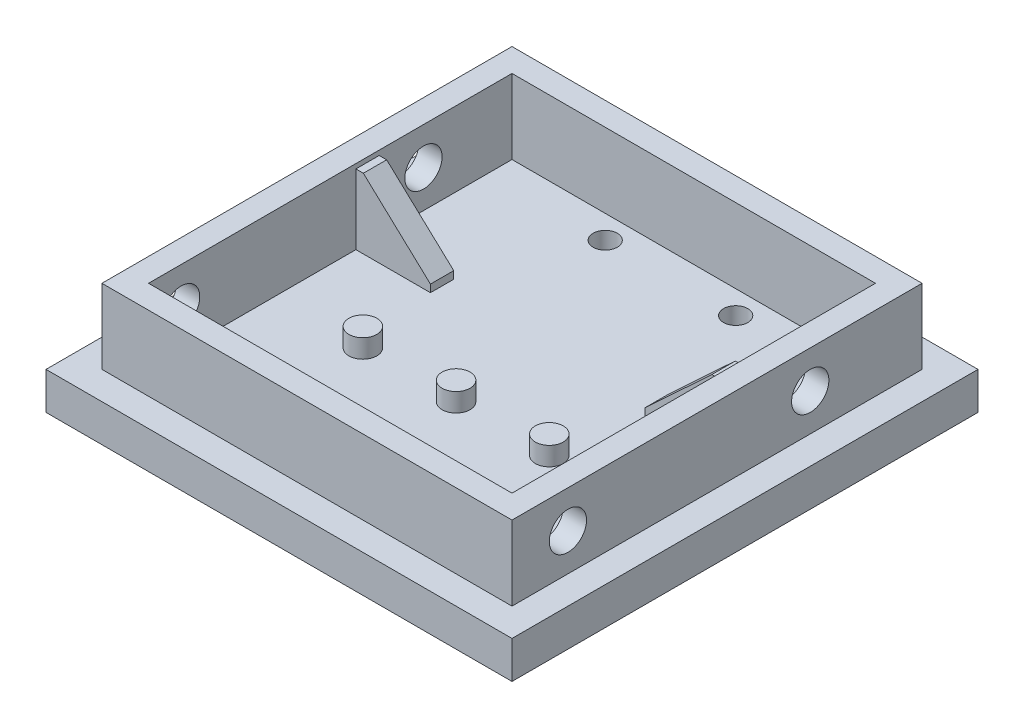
ISO-10303-21;
HEADER;
FILE_DESCRIPTION(('STEP AP214'),'2;1');
FILE_NAME('part.step','',(''),(''),'','','');
FILE_SCHEMA(('AUTOMOTIVE_DESIGN { 1 0 10303 214 1 1 1 1 }'));
ENDSEC;
DATA;
#1=APPLICATION_CONTEXT('core data for automotive mechanical design processes');
#2=APPLICATION_PROTOCOL_DEFINITION('international standard','automotive_design',2000,#1);
#3=PRODUCT_CONTEXT('',#1,'mechanical');
#4=PRODUCT('Part','Part','',(#3));
#5=PRODUCT_RELATED_PRODUCT_CATEGORY('part','',(#4));
#6=PRODUCT_DEFINITION_FORMATION('','',#4);
#7=PRODUCT_DEFINITION_CONTEXT('part definition',#1,'design');
#8=PRODUCT_DEFINITION('design','',#6,#7);
#9=PRODUCT_DEFINITION_SHAPE('','',#8);
#10=(LENGTH_UNIT() NAMED_UNIT(*) SI_UNIT(.MILLI.,.METRE.));
#11=(NAMED_UNIT(*) PLANE_ANGLE_UNIT() SI_UNIT($,.RADIAN.));
#12=(NAMED_UNIT(*) SI_UNIT($,.STERADIAN.) SOLID_ANGLE_UNIT());
#13=UNCERTAINTY_MEASURE_WITH_UNIT(LENGTH_MEASURE(1.E-05),#10,'distance_accuracy_value','');
#14=(GEOMETRIC_REPRESENTATION_CONTEXT(3) GLOBAL_UNCERTAINTY_ASSIGNED_CONTEXT((#13)) GLOBAL_UNIT_ASSIGNED_CONTEXT((#10,
#11,#12)) REPRESENTATION_CONTEXT('',''));
#15=CARTESIAN_POINT('',(0.,0.,0.));
#16=DIRECTION('',(0.,0.,1.));
#17=DIRECTION('',(1.,0.,0.));
#18=AXIS2_PLACEMENT_3D('',#15,#16,#17);
#19=CARTESIAN_POINT('',(0.,4.,0.));
#20=DIRECTION('',(0.,-1.,0.));
#21=DIRECTION('',(0.,0.,-1.));
#22=AXIS2_PLACEMENT_3D('',#19,#20,#21);
#23=PLANE('',#22);
#24=CARTESIAN_POINT('',(-7.,4.,-17.));
#25=DIRECTION('',(0.,1.,0.));
#26=DIRECTION('',(0.,0.,1.));
#27=AXIS2_PLACEMENT_3D('',#24,#25,#26);
#28=CIRCLE('',#27,1.3);
#29=CARTESIAN_POINT('',(-7.,4.,-15.7));
#30=VERTEX_POINT('',#29);
#31=EDGE_CURVE('E290',#30,#30,#28,.T.);
#32=ORIENTED_EDGE('',*,*,#31,.F.);
#33=EDGE_LOOP('',(#32));
#34=FACE_BOUND('',#33,.T.);
#35=CARTESIAN_POINT('',(7.,4.,-17.));
#36=DIRECTION('',(0.,1.,0.));
#37=DIRECTION('',(0.,0.,1.));
#38=AXIS2_PLACEMENT_3D('',#35,#36,#37);
#39=CIRCLE('',#38,1.3);
#40=CARTESIAN_POINT('',(7.,4.,-15.7));
#41=VERTEX_POINT('',#40);
#42=EDGE_CURVE('E296',#41,#41,#39,.T.);
#43=ORIENTED_EDGE('',*,*,#42,.F.);
#44=EDGE_LOOP('',(#43));
#45=FACE_BOUND('',#44,.T.);
#46=CARTESIAN_POINT('',(0.,4.,6.));
#47=DIRECTION('',(0.,-1.,0.));
#48=DIRECTION('',(0.,0.,-1.));
#49=AXIS2_PLACEMENT_3D('',#46,#47,#48);
#50=CIRCLE('',#49,1.5);
#51=CARTESIAN_POINT('',(0.,4.,4.5));
#52=VERTEX_POINT('',#51);
#53=EDGE_CURVE('E332',#52,#52,#50,.F.);
#54=ORIENTED_EDGE('',*,*,#53,.F.);
#55=EDGE_LOOP('',(#54));
#56=FACE_BOUND('',#55,.T.);
#57=CARTESIAN_POINT('',(10.,4.,6.));
#58=DIRECTION('',(0.,-1.,0.));
#59=DIRECTION('',(0.,0.,-1.));
#60=AXIS2_PLACEMENT_3D('',#57,#58,#59);
#61=CIRCLE('',#60,1.5);
#62=CARTESIAN_POINT('',(10.,4.,4.5));
#63=VERTEX_POINT('',#62);
#64=EDGE_CURVE('E68',#63,#63,#61,.F.);
#65=ORIENTED_EDGE('',*,*,#64,.F.);
#66=EDGE_LOOP('',(#65));
#67=FACE_BOUND('',#66,.T.);
#68=CARTESIAN_POINT('',(-10.,4.,6.));
#69=DIRECTION('',(0.,-1.,0.));
#70=DIRECTION('',(0.,0.,-1.));
#71=AXIS2_PLACEMENT_3D('',#68,#69,#70);
#72=CIRCLE('',#71,1.5);
#73=CARTESIAN_POINT('',(-10.,4.,4.5));
#74=VERTEX_POINT('',#73);
#75=EDGE_CURVE('E12',#74,#74,#72,.F.);
#76=ORIENTED_EDGE('',*,*,#75,.F.);
#77=EDGE_LOOP('',(#76));
#78=FACE_BOUND('',#77,.T.);
#79=DIRECTION('',(0.,0.,-1.));
#80=VECTOR('',#79,1.);
#81=CARTESIAN_POINT('',(19.5,4.,19.5));
#82=LINE('',#81,#80);
#83=CARTESIAN_POINT('',(19.5,4.,19.5));
#84=VERTEX_POINT('',#83);
#85=CARTESIAN_POINT('',(19.5,4.,-2.75));
#86=VERTEX_POINT('',#85);
#87=EDGE_CURVE('E230',#84,#86,#82,.T.);
#88=ORIENTED_EDGE('',*,*,#87,.T.);
#89=DIRECTION('',(1.,0.,0.));
#90=VECTOR('',#89,1.);
#91=CARTESIAN_POINT('',(11.5,4.,-2.75));
#92=LINE('',#91,#90);
#93=CARTESIAN_POINT('',(11.5,4.,-2.75));
#94=VERTEX_POINT('',#93);
#95=EDGE_CURVE('E211',#94,#86,#92,.T.);
#96=ORIENTED_EDGE('',*,*,#95,.F.);
#97=DIRECTION('',(0.,0.,-1.));
#98=VECTOR('',#97,1.);
#99=CARTESIAN_POINT('',(11.5,4.,-2.75));
#100=LINE('',#99,#98);
#101=CARTESIAN_POINT('',(11.5,4.,-5.25));
#102=VERTEX_POINT('',#101);
#103=EDGE_CURVE('E409',#94,#102,#100,.T.);
#104=ORIENTED_EDGE('',*,*,#103,.T.);
#105=DIRECTION('',(1.,0.,0.));
#106=VECTOR('',#105,1.);
#107=CARTESIAN_POINT('',(11.5,4.,-5.25));
#108=LINE('',#107,#106);
#109=CARTESIAN_POINT('',(19.5,4.,-5.25));
#110=VERTEX_POINT('',#109);
#111=EDGE_CURVE('E400',#102,#110,#108,.T.);
#112=ORIENTED_EDGE('',*,*,#111,.T.);
#113=CARTESIAN_POINT('',(19.5,4.,-19.5));
#114=VERTEX_POINT('',#113);
#115=EDGE_CURVE('E238',#110,#114,#82,.T.);
#116=ORIENTED_EDGE('',*,*,#115,.T.);
#117=DIRECTION('',(1.,0.,0.));
#118=VECTOR('',#117,1.);
#119=CARTESIAN_POINT('',(-19.5,4.,-19.5));
#120=LINE('',#119,#118);
#121=CARTESIAN_POINT('',(-19.5,4.,-19.5));
#122=VERTEX_POINT('',#121);
#123=EDGE_CURVE('E242',#122,#114,#120,.T.);
#124=ORIENTED_EDGE('',*,*,#123,.F.);
#125=DIRECTION('',(0.,0.,-1.));
#126=VECTOR('',#125,1.);
#127=CARTESIAN_POINT('',(-19.5,4.,19.5));
#128=LINE('',#127,#126);
#129=CARTESIAN_POINT('',(-19.5,4.,-5.25));
#130=VERTEX_POINT('',#129);
#131=EDGE_CURVE('E366',#130,#122,#128,.T.);
#132=ORIENTED_EDGE('',*,*,#131,.F.);
#133=DIRECTION('',(1.,0.,0.));
#134=VECTOR('',#133,1.);
#135=CARTESIAN_POINT('',(-11.5,4.,-5.25));
#136=LINE('',#135,#134);
#137=CARTESIAN_POINT('',(-11.5,4.,-5.25));
#138=VERTEX_POINT('',#137);
#139=EDGE_CURVE('E84',#130,#138,#136,.T.);
#140=ORIENTED_EDGE('',*,*,#139,.T.);
#141=DIRECTION('',(0.,0.,-1.));
#142=VECTOR('',#141,1.);
#143=CARTESIAN_POINT('',(-11.5,4.,-2.75));
#144=LINE('',#143,#142);
#145=CARTESIAN_POINT('',(-11.5,4.,-2.75));
#146=VERTEX_POINT('',#145);
#147=EDGE_CURVE('E444',#146,#138,#144,.T.);
#148=ORIENTED_EDGE('',*,*,#147,.F.);
#149=DIRECTION('',(1.,0.,0.));
#150=VECTOR('',#149,1.);
#151=CARTESIAN_POINT('',(-11.5,4.,-2.75));
#152=LINE('',#151,#150);
#153=CARTESIAN_POINT('',(-19.5,4.,-2.75));
#154=VERTEX_POINT('',#153);
#155=EDGE_CURVE('E420',#154,#146,#152,.T.);
#156=ORIENTED_EDGE('',*,*,#155,.F.);
#157=CARTESIAN_POINT('',(-19.5,4.,19.5));
#158=VERTEX_POINT('',#157);
#159=EDGE_CURVE('E375',#158,#154,#128,.T.);
#160=ORIENTED_EDGE('',*,*,#159,.F.);
#161=DIRECTION('',(1.,0.,0.));
#162=VECTOR('',#161,1.);
#163=CARTESIAN_POINT('',(-19.5,4.,19.5));
#164=LINE('',#163,#162);
#165=EDGE_CURVE('E236',#158,#84,#164,.T.);
#166=ORIENTED_EDGE('',*,*,#165,.T.);
#167=EDGE_LOOP('',(#88,#96,#104,#112,#116,#124,#132,#140,#148,#156,#160,#166));
#168=FACE_BOUND('',#167,.T.);
#169=ADVANCED_FACE('F59',(#34,#45,#56,#67,#78,#168),#23,.F.);
#170=CARTESIAN_POINT('',(-19.5,12.,19.5));
#171=DIRECTION('',(-1.,0.,0.));
#172=DIRECTION('',(0.,0.,1.));
#173=AXIS2_PLACEMENT_3D('',#170,#171,#172);
#174=PLANE('',#173);
#175=CARTESIAN_POINT('',(-19.5,8.,16.));
#176=DIRECTION('',(-1.,0.,0.));
#177=DIRECTION('',(0.,0.,1.));
#178=AXIS2_PLACEMENT_3D('',#175,#176,#177);
#179=CIRCLE('',#178,2.);
#180=CARTESIAN_POINT('',(-19.5,8.,18.));
#181=VERTEX_POINT('',#180);
#182=EDGE_CURVE('E338',#181,#181,#179,.T.);
#183=ORIENTED_EDGE('',*,*,#182,.T.);
#184=EDGE_LOOP('',(#183));
#185=FACE_BOUND('',#184,.T.);
#186=CARTESIAN_POINT('',(-19.5,8.,-10.));
#187=DIRECTION('',(-1.,0.,0.));
#188=DIRECTION('',(0.,0.,1.));
#189=AXIS2_PLACEMENT_3D('',#186,#187,#188);
#190=CIRCLE('',#189,2.);
#191=CARTESIAN_POINT('',(-19.5,8.,-8.00000000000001));
#192=VERTEX_POINT('',#191);
#193=EDGE_CURVE('E351',#192,#192,#190,.T.);
#194=ORIENTED_EDGE('',*,*,#193,.T.);
#195=EDGE_LOOP('',(#194));
#196=FACE_BOUND('',#195,.T.);
#197=DIRECTION('',(0.,-1.,0.));
#198=VECTOR('',#197,1.);
#199=CARTESIAN_POINT('',(-19.5,4.,-2.75));
#200=LINE('',#199,#198);
#201=CARTESIAN_POINT('',(-19.5,11.5,-2.75));
#202=VERTEX_POINT('',#201);
#203=EDGE_CURVE('E418',#202,#154,#200,.T.);
#204=ORIENTED_EDGE('',*,*,#203,.F.);
#205=DIRECTION('',(0.,0.,-1.));
#206=VECTOR('',#205,1.);
#207=CARTESIAN_POINT('',(-19.5,11.5,-2.75));
#208=LINE('',#207,#206);
#209=CARTESIAN_POINT('',(-19.5,11.5,-5.25));
#210=VERTEX_POINT('',#209);
#211=EDGE_CURVE('E429',#202,#210,#208,.T.);
#212=ORIENTED_EDGE('',*,*,#211,.T.);
#213=DIRECTION('',(0.,-1.,0.));
#214=VECTOR('',#213,1.);
#215=CARTESIAN_POINT('',(-19.5,4.,-5.25));
#216=LINE('',#215,#214);
#217=EDGE_CURVE('E386',#210,#130,#216,.T.);
#218=ORIENTED_EDGE('',*,*,#217,.T.);
#219=ORIENTED_EDGE('',*,*,#131,.T.);
#220=DIRECTION('',(0.,-1.,0.));
#221=VECTOR('',#220,1.);
#222=CARTESIAN_POINT('',(-19.5,12.,-19.5));
#223=LINE('',#222,#221);
#224=CARTESIAN_POINT('',(-19.5,12.,-19.5));
#225=VERTEX_POINT('',#224);
#226=EDGE_CURVE('E255',#225,#122,#223,.T.);
#227=ORIENTED_EDGE('',*,*,#226,.F.);
#228=DIRECTION('',(0.,0.,-1.));
#229=VECTOR('',#228,1.);
#230=CARTESIAN_POINT('',(-19.5,12.,19.5));
#231=LINE('',#230,#229);
#232=CARTESIAN_POINT('',(-19.5,12.,19.5));
#233=VERTEX_POINT('',#232);
#234=EDGE_CURVE('E240',#233,#225,#231,.T.);
#235=ORIENTED_EDGE('',*,*,#234,.F.);
#236=DIRECTION('',(0.,-1.,0.));
#237=VECTOR('',#236,1.);
#238=CARTESIAN_POINT('',(-19.5,12.,19.5));
#239=LINE('',#238,#237);
#240=EDGE_CURVE('E246',#233,#158,#239,.T.);
#241=ORIENTED_EDGE('',*,*,#240,.T.);
#242=ORIENTED_EDGE('',*,*,#159,.T.);
#243=EDGE_LOOP('',(#204,#212,#218,#219,#227,#235,#241,#242));
#244=FACE_BOUND('',#243,.T.);
#245=ADVANCED_FACE('F382',(#185,#196,#244),#174,.F.);
#246=DIRECTION('',(0.,0.,-1.));
#247=VECTOR('',#246,1.);
#248=CARTESIAN_POINT('',(25.,4.,25.));
#249=LINE('',#248,#247);
#250=CARTESIAN_POINT('',(25.,4.,25.));
#251=VERTEX_POINT('',#250);
#252=CARTESIAN_POINT('',(25.,4.,-25.));
#253=VERTEX_POINT('',#252);
#254=EDGE_CURVE('E303',#251,#253,#249,.T.);
#255=ORIENTED_EDGE('',*,*,#254,.T.);
#256=DIRECTION('',(-1.,0.,0.));
#257=VECTOR('',#256,1.);
#258=CARTESIAN_POINT('',(-25.,4.,-25.));
#259=LINE('',#258,#257);
#260=CARTESIAN_POINT('',(-25.,4.,-25.));
#261=VERTEX_POINT('',#260);
#262=EDGE_CURVE('E306',#253,#261,#259,.T.);
#263=ORIENTED_EDGE('',*,*,#262,.T.);
#264=DIRECTION('',(0.,0.,1.));
#265=VECTOR('',#264,1.);
#266=CARTESIAN_POINT('',(-25.,4.,25.));
#267=LINE('',#266,#265);
#268=CARTESIAN_POINT('',(-25.,4.,25.));
#269=VERTEX_POINT('',#268);
#270=EDGE_CURVE('E309',#261,#269,#267,.T.);
#271=ORIENTED_EDGE('',*,*,#270,.T.);
#272=DIRECTION('',(1.,0.,0.));
#273=VECTOR('',#272,1.);
#274=CARTESIAN_POINT('',(-25.,4.,25.));
#275=LINE('',#274,#273);
#276=EDGE_CURVE('E311',#269,#251,#275,.T.);
#277=ORIENTED_EDGE('',*,*,#276,.T.);
#278=EDGE_LOOP('',(#255,#263,#271,#277));
#279=FACE_BOUND('',#278,.T.);
#280=DIRECTION('',(1.,0.,0.));
#281=VECTOR('',#280,1.);
#282=CARTESIAN_POINT('',(-22.,4.,22.));
#283=LINE('',#282,#281);
#284=CARTESIAN_POINT('',(-22.,4.,22.));
#285=VERTEX_POINT('',#284);
#286=CARTESIAN_POINT('',(22.,4.,22.));
#287=VERTEX_POINT('',#286);
#288=EDGE_CURVE('E249',#285,#287,#283,.T.);
#289=ORIENTED_EDGE('',*,*,#288,.F.);
#290=DIRECTION('',(0.,0.,-1.));
#291=VECTOR('',#290,1.);
#292=CARTESIAN_POINT('',(-22.,4.,22.));
#293=LINE('',#292,#291);
#294=CARTESIAN_POINT('',(-22.,4.,-22.));
#295=VERTEX_POINT('',#294);
#296=EDGE_CURVE('E263',#285,#295,#293,.T.);
#297=ORIENTED_EDGE('',*,*,#296,.T.);
#298=DIRECTION('',(1.,0.,0.));
#299=VECTOR('',#298,1.);
#300=CARTESIAN_POINT('',(-22.,4.,-22.));
#301=LINE('',#300,#299);
#302=CARTESIAN_POINT('',(22.,4.,-22.));
#303=VERTEX_POINT('',#302);
#304=EDGE_CURVE('E277',#295,#303,#301,.T.);
#305=ORIENTED_EDGE('',*,*,#304,.T.);
#306=DIRECTION('',(0.,0.,-1.));
#307=VECTOR('',#306,1.);
#308=CARTESIAN_POINT('',(22.,4.,22.));
#309=LINE('',#308,#307);
#310=EDGE_CURVE('E274',#287,#303,#309,.T.);
#311=ORIENTED_EDGE('',*,*,#310,.F.);
#312=EDGE_LOOP('',(#289,#297,#305,#311));
#313=FACE_BOUND('',#312,.T.);
#314=ADVANCED_FACE('F469',(#279,#313),#23,.F.);
#315=CARTESIAN_POINT('',(25.,4.,25.));
#316=DIRECTION('',(-1.,0.,0.));
#317=DIRECTION('',(0.,0.,1.));
#318=AXIS2_PLACEMENT_3D('',#315,#316,#317);
#319=PLANE('',#318);
#320=DIRECTION('',(0.,0.,-1.));
#321=VECTOR('',#320,1.);
#322=CARTESIAN_POINT('',(25.,0.,25.));
#323=LINE('',#322,#321);
#324=CARTESIAN_POINT('',(25.,0.,25.));
#325=VERTEX_POINT('',#324);
#326=CARTESIAN_POINT('',(25.,0.,-25.));
#327=VERTEX_POINT('',#326);
#328=EDGE_CURVE('E302',#325,#327,#323,.T.);
#329=ORIENTED_EDGE('',*,*,#328,.T.);
#330=DIRECTION('',(0.,-1.,0.));
#331=VECTOR('',#330,1.);
#332=CARTESIAN_POINT('',(25.,4.,-25.));
#333=LINE('',#332,#331);
#334=EDGE_CURVE('E329',#253,#327,#333,.T.);
#335=ORIENTED_EDGE('',*,*,#334,.F.);
#336=ORIENTED_EDGE('',*,*,#254,.F.);
#337=DIRECTION('',(0.,-1.,0.));
#338=VECTOR('',#337,1.);
#339=CARTESIAN_POINT('',(25.,4.,25.));
#340=LINE('',#339,#338);
#341=EDGE_CURVE('E313',#251,#325,#340,.T.);
#342=ORIENTED_EDGE('',*,*,#341,.T.);
#343=EDGE_LOOP('',(#329,#335,#336,#342));
#344=FACE_BOUND('',#343,.T.);
#345=ADVANCED_FACE('F61',(#344),#319,.F.);
#346=CARTESIAN_POINT('',(-25.,4.,-25.));
#347=DIRECTION('',(0.,0.,1.));
#348=DIRECTION('',(1.,0.,0.));
#349=AXIS2_PLACEMENT_3D('',#346,#347,#348);
#350=PLANE('',#349);
#351=DIRECTION('',(-1.,0.,0.));
#352=VECTOR('',#351,1.);
#353=CARTESIAN_POINT('',(-25.,0.,-25.));
#354=LINE('',#353,#352);
#355=CARTESIAN_POINT('',(-25.,0.,-25.));
#356=VERTEX_POINT('',#355);
#357=EDGE_CURVE('E316',#327,#356,#354,.T.);
#358=ORIENTED_EDGE('',*,*,#357,.T.);
#359=DIRECTION('',(0.,-1.,0.));
#360=VECTOR('',#359,1.);
#361=CARTESIAN_POINT('',(-25.,4.,-25.));
#362=LINE('',#361,#360);
#363=EDGE_CURVE('E326',#261,#356,#362,.T.);
#364=ORIENTED_EDGE('',*,*,#363,.F.);
#365=ORIENTED_EDGE('',*,*,#262,.F.);
#366=ORIENTED_EDGE('',*,*,#334,.T.);
#367=EDGE_LOOP('',(#358,#364,#365,#366));
#368=FACE_BOUND('',#367,.T.);
#369=ADVANCED_FACE('F484',(#368),#350,.F.);
#370=CARTESIAN_POINT('',(-25.,4.,25.));
#371=DIRECTION('',(1.,0.,0.));
#372=DIRECTION('',(0.,0.,-1.));
#373=AXIS2_PLACEMENT_3D('',#370,#371,#372);
#374=PLANE('',#373);
#375=DIRECTION('',(0.,0.,1.));
#376=VECTOR('',#375,1.);
#377=CARTESIAN_POINT('',(-25.,0.,25.));
#378=LINE('',#377,#376);
#379=CARTESIAN_POINT('',(-25.,0.,25.));
#380=VERTEX_POINT('',#379);
#381=EDGE_CURVE('E318',#356,#380,#378,.T.);
#382=ORIENTED_EDGE('',*,*,#381,.T.);
#383=DIRECTION('',(0.,-1.,0.));
#384=VECTOR('',#383,1.);
#385=CARTESIAN_POINT('',(-25.,4.,25.));
#386=LINE('',#385,#384);
#387=EDGE_CURVE('E323',#269,#380,#386,.T.);
#388=ORIENTED_EDGE('',*,*,#387,.F.);
#389=ORIENTED_EDGE('',*,*,#270,.F.);
#390=ORIENTED_EDGE('',*,*,#363,.T.);
#391=EDGE_LOOP('',(#382,#388,#389,#390));
#392=FACE_BOUND('',#391,.T.);
#393=ADVANCED_FACE('F543',(#392),#374,.F.);
#394=CARTESIAN_POINT('',(-25.,4.,25.));
#395=DIRECTION('',(0.,0.,-1.));
#396=DIRECTION('',(-1.,0.,0.));
#397=AXIS2_PLACEMENT_3D('',#394,#395,#396);
#398=PLANE('',#397);
#399=DIRECTION('',(1.,0.,0.));
#400=VECTOR('',#399,1.);
#401=CARTESIAN_POINT('',(-25.,0.,25.));
#402=LINE('',#401,#400);
#403=EDGE_CURVE('E307',#380,#325,#402,.T.);
#404=ORIENTED_EDGE('',*,*,#403,.T.);
#405=ORIENTED_EDGE('',*,*,#341,.F.);
#406=ORIENTED_EDGE('',*,*,#276,.F.);
#407=ORIENTED_EDGE('',*,*,#387,.T.);
#408=EDGE_LOOP('',(#404,#405,#406,#407));
#409=FACE_BOUND('',#408,.T.);
#410=ADVANCED_FACE('F527',(#409),#398,.F.);
#411=CARTESIAN_POINT('',(0.,0.,0.));
#412=DIRECTION('',(0.,-1.,0.));
#413=DIRECTION('',(0.,0.,-1.));
#414=AXIS2_PLACEMENT_3D('',#411,#412,#413);
#415=PLANE('',#414);
#416=CARTESIAN_POINT('',(-7.,0.,-17.));
#417=DIRECTION('',(0.,-1.,0.));
#418=DIRECTION('',(0.,0.,-1.));
#419=AXIS2_PLACEMENT_3D('',#416,#417,#418);
#420=CIRCLE('',#419,1.3);
#421=CARTESIAN_POINT('',(-7.,0.,-18.3));
#422=VERTEX_POINT('',#421);
#423=EDGE_CURVE('E293',#422,#422,#420,.F.);
#424=ORIENTED_EDGE('',*,*,#423,.T.);
#425=EDGE_LOOP('',(#424));
#426=FACE_BOUND('',#425,.T.);
#427=CARTESIAN_POINT('',(7.,0.,-17.));
#428=DIRECTION('',(0.,-1.,0.));
#429=DIRECTION('',(0.,0.,-1.));
#430=AXIS2_PLACEMENT_3D('',#427,#428,#429);
#431=CIRCLE('',#430,1.3);
#432=CARTESIAN_POINT('',(7.,0.,-18.3));
#433=VERTEX_POINT('',#432);
#434=EDGE_CURVE('E299',#433,#433,#431,.F.);
#435=ORIENTED_EDGE('',*,*,#434,.T.);
#436=EDGE_LOOP('',(#435));
#437=FACE_BOUND('',#436,.T.);
#438=ORIENTED_EDGE('',*,*,#328,.F.);
#439=ORIENTED_EDGE('',*,*,#403,.F.);
#440=ORIENTED_EDGE('',*,*,#381,.F.);
#441=ORIENTED_EDGE('',*,*,#357,.F.);
#442=EDGE_LOOP('',(#438,#439,#440,#441));
#443=FACE_BOUND('',#442,.T.);
#444=ADVANCED_FACE('F522',(#426,#437,#443),#415,.T.);
#445=CARTESIAN_POINT('',(7.,-3.67695526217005,-17.));
#446=DIRECTION('',(0.,1.,0.));
#447=DIRECTION('',(0.,0.,1.));
#448=AXIS2_PLACEMENT_3D('',#445,#446,#447);
#449=CYLINDRICAL_SURFACE('',#448,1.3);
#450=ORIENTED_EDGE('',*,*,#42,.T.);
#451=EDGE_LOOP('',(#450));
#452=FACE_BOUND('',#451,.T.);
#453=ORIENTED_EDGE('',*,*,#434,.F.);
#454=EDGE_LOOP('',(#453));
#455=FACE_BOUND('',#454,.T.);
#456=ADVANCED_FACE('F519',(#452,#455),#449,.F.);
#457=CARTESIAN_POINT('',(-7.,-3.67695526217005,-17.));
#458=DIRECTION('',(0.,1.,0.));
#459=DIRECTION('',(0.,0.,1.));
#460=AXIS2_PLACEMENT_3D('',#457,#458,#459);
#461=CYLINDRICAL_SURFACE('',#460,1.3);
#462=ORIENTED_EDGE('',*,*,#31,.T.);
#463=EDGE_LOOP('',(#462));
#464=FACE_BOUND('',#463,.T.);
#465=ORIENTED_EDGE('',*,*,#423,.F.);
#466=EDGE_LOOP('',(#465));
#467=FACE_BOUND('',#466,.T.);
#468=ADVANCED_FACE('F513',(#464,#467),#461,.F.);
#469=CARTESIAN_POINT('',(-22.,12.,22.));
#470=DIRECTION('',(0.,0.,-1.));
#471=DIRECTION('',(-1.,0.,0.));
#472=AXIS2_PLACEMENT_3D('',#469,#470,#471);
#473=PLANE('',#472);
#474=ORIENTED_EDGE('',*,*,#288,.T.);
#475=DIRECTION('',(0.,-1.,0.));
#476=VECTOR('',#475,1.);
#477=CARTESIAN_POINT('',(22.,12.,22.));
#478=LINE('',#477,#476);
#479=CARTESIAN_POINT('',(22.,12.,22.));
#480=VERTEX_POINT('',#479);
#481=EDGE_CURVE('E288',#480,#287,#478,.T.);
#482=ORIENTED_EDGE('',*,*,#481,.F.);
#483=DIRECTION('',(1.,0.,0.));
#484=VECTOR('',#483,1.);
#485=CARTESIAN_POINT('',(-22.,12.,22.));
#486=LINE('',#485,#484);
#487=CARTESIAN_POINT('',(-22.,12.,22.));
#488=VERTEX_POINT('',#487);
#489=EDGE_CURVE('E259',#488,#480,#486,.T.);
#490=ORIENTED_EDGE('',*,*,#489,.F.);
#491=DIRECTION('',(0.,-1.,0.));
#492=VECTOR('',#491,1.);
#493=CARTESIAN_POINT('',(-22.,12.,22.));
#494=LINE('',#493,#492);
#495=EDGE_CURVE('E271',#488,#285,#494,.T.);
#496=ORIENTED_EDGE('',*,*,#495,.T.);
#497=EDGE_LOOP('',(#474,#482,#490,#496));
#498=FACE_BOUND('',#497,.T.);
#499=ADVANCED_FACE('F494',(#498),#473,.F.);
#500=CARTESIAN_POINT('',(22.,12.,22.));
#501=DIRECTION('',(-1.,0.,0.));
#502=DIRECTION('',(0.,0.,1.));
#503=AXIS2_PLACEMENT_3D('',#500,#501,#502);
#504=PLANE('',#503);
#505=CARTESIAN_POINT('',(22.,8.,-10.));
#506=DIRECTION('',(-1.,0.,0.));
#507=DIRECTION('',(0.,0.,1.));
#508=AXIS2_PLACEMENT_3D('',#505,#506,#507);
#509=CIRCLE('',#508,2.);
#510=CARTESIAN_POINT('',(22.,8.,-8.00000000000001));
#511=VERTEX_POINT('',#510);
#512=EDGE_CURVE('E346',#511,#511,#509,.T.);
#513=ORIENTED_EDGE('',*,*,#512,.T.);
#514=EDGE_LOOP('',(#513));
#515=FACE_BOUND('',#514,.T.);
#516=CARTESIAN_POINT('',(22.,8.,16.));
#517=DIRECTION('',(-1.,0.,0.));
#518=DIRECTION('',(0.,0.,1.));
#519=AXIS2_PLACEMENT_3D('',#516,#517,#518);
#520=CIRCLE('',#519,2.);
#521=CARTESIAN_POINT('',(22.,8.,18.));
#522=VERTEX_POINT('',#521);
#523=EDGE_CURVE('E343',#522,#522,#520,.T.);
#524=ORIENTED_EDGE('',*,*,#523,.T.);
#525=EDGE_LOOP('',(#524));
#526=FACE_BOUND('',#525,.T.);
#527=ORIENTED_EDGE('',*,*,#310,.T.);
#528=DIRECTION('',(0.,-1.,0.));
#529=VECTOR('',#528,1.);
#530=CARTESIAN_POINT('',(22.,12.,-22.));
#531=LINE('',#530,#529);
#532=CARTESIAN_POINT('',(22.,12.,-22.));
#533=VERTEX_POINT('',#532);
#534=EDGE_CURVE('E286',#533,#303,#531,.T.);
#535=ORIENTED_EDGE('',*,*,#534,.F.);
#536=DIRECTION('',(0.,0.,-1.));
#537=VECTOR('',#536,1.);
#538=CARTESIAN_POINT('',(22.,12.,22.));
#539=LINE('',#538,#537);
#540=EDGE_CURVE('E262',#480,#533,#539,.T.);
#541=ORIENTED_EDGE('',*,*,#540,.F.);
#542=ORIENTED_EDGE('',*,*,#481,.T.);
#543=EDGE_LOOP('',(#527,#535,#541,#542));
#544=FACE_BOUND('',#543,.T.);
#545=ADVANCED_FACE('F504',(#515,#526,#544),#504,.F.);
#546=CARTESIAN_POINT('',(-22.,12.,-22.));
#547=DIRECTION('',(0.,0.,-1.));
#548=DIRECTION('',(-1.,0.,0.));
#549=AXIS2_PLACEMENT_3D('',#546,#547,#548);
#550=PLANE('',#549);
#551=ORIENTED_EDGE('',*,*,#304,.F.);
#552=DIRECTION('',(0.,-1.,0.));
#553=VECTOR('',#552,1.);
#554=CARTESIAN_POINT('',(-22.,12.,-22.));
#555=LINE('',#554,#553);
#556=CARTESIAN_POINT('',(-22.,12.,-22.));
#557=VERTEX_POINT('',#556);
#558=EDGE_CURVE('E283',#557,#295,#555,.T.);
#559=ORIENTED_EDGE('',*,*,#558,.F.);
#560=DIRECTION('',(1.,0.,0.));
#561=VECTOR('',#560,1.);
#562=CARTESIAN_POINT('',(-22.,12.,-22.));
#563=LINE('',#562,#561);
#564=EDGE_CURVE('E265',#557,#533,#563,.T.);
#565=ORIENTED_EDGE('',*,*,#564,.T.);
#566=ORIENTED_EDGE('',*,*,#534,.T.);
#567=EDGE_LOOP('',(#551,#559,#565,#566));
#568=FACE_BOUND('',#567,.T.);
#569=ADVANCED_FACE('F501',(#568),#550,.T.);
#570=CARTESIAN_POINT('',(-22.,12.,22.));
#571=DIRECTION('',(-1.,0.,0.));
#572=DIRECTION('',(0.,0.,1.));
#573=AXIS2_PLACEMENT_3D('',#570,#571,#572);
#574=PLANE('',#573);
#575=CARTESIAN_POINT('',(-22.,8.,-10.));
#576=DIRECTION('',(-1.,0.,0.));
#577=DIRECTION('',(0.,0.,1.));
#578=AXIS2_PLACEMENT_3D('',#575,#576,#577);
#579=CIRCLE('',#578,2.);
#580=CARTESIAN_POINT('',(-22.,8.,-8.00000000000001));
#581=VERTEX_POINT('',#580);
#582=EDGE_CURVE('E446',#581,#581,#579,.T.);
#583=ORIENTED_EDGE('',*,*,#582,.F.);
#584=EDGE_LOOP('',(#583));
#585=FACE_BOUND('',#584,.T.);
#586=CARTESIAN_POINT('',(-22.,8.,16.));
#587=DIRECTION('',(-1.,0.,0.));
#588=DIRECTION('',(0.,0.,1.));
#589=AXIS2_PLACEMENT_3D('',#586,#587,#588);
#590=CIRCLE('',#589,2.);
#591=CARTESIAN_POINT('',(-22.,8.,18.));
#592=VERTEX_POINT('',#591);
#593=EDGE_CURVE('E339',#592,#592,#590,.T.);
#594=ORIENTED_EDGE('',*,*,#593,.F.);
#595=EDGE_LOOP('',(#594));
#596=FACE_BOUND('',#595,.T.);
#597=ORIENTED_EDGE('',*,*,#296,.F.);
#598=ORIENTED_EDGE('',*,*,#495,.F.);
#599=DIRECTION('',(0.,0.,-1.));
#600=VECTOR('',#599,1.);
#601=CARTESIAN_POINT('',(-22.,12.,22.));
#602=LINE('',#601,#600);
#603=EDGE_CURVE('E268',#488,#557,#602,.T.);
#604=ORIENTED_EDGE('',*,*,#603,.T.);
#605=ORIENTED_EDGE('',*,*,#558,.T.);
#606=EDGE_LOOP('',(#597,#598,#604,#605));
#607=FACE_BOUND('',#606,.T.);
#608=ADVANCED_FACE('F498',(#585,#596,#607),#574,.T.);
#609=CARTESIAN_POINT('',(0.,12.,0.));
#610=DIRECTION('',(0.,1.,0.));
#611=DIRECTION('',(0.,0.,1.));
#612=AXIS2_PLACEMENT_3D('',#609,#610,#611);
#613=PLANE('',#612);
#614=ORIENTED_EDGE('',*,*,#234,.T.);
#615=DIRECTION('',(1.,0.,0.));
#616=VECTOR('',#615,1.);
#617=CARTESIAN_POINT('',(-19.5,12.,-19.5));
#618=LINE('',#617,#616);
#619=CARTESIAN_POINT('',(19.5,12.,-19.5));
#620=VERTEX_POINT('',#619);
#621=EDGE_CURVE('E369',#225,#620,#618,.T.);
#622=ORIENTED_EDGE('',*,*,#621,.T.);
#623=DIRECTION('',(0.,0.,-1.));
#624=VECTOR('',#623,1.);
#625=CARTESIAN_POINT('',(19.5,12.,19.5));
#626=LINE('',#625,#624);
#627=CARTESIAN_POINT('',(19.5,12.,19.5));
#628=VERTEX_POINT('',#627);
#629=EDGE_CURVE('E372',#628,#620,#626,.T.);
#630=ORIENTED_EDGE('',*,*,#629,.F.);
#631=DIRECTION('',(1.,0.,0.));
#632=VECTOR('',#631,1.);
#633=CARTESIAN_POINT('',(-19.5,12.,19.5));
#634=LINE('',#633,#632);
#635=EDGE_CURVE('E258',#233,#628,#634,.T.);
#636=ORIENTED_EDGE('',*,*,#635,.F.);
#637=EDGE_LOOP('',(#614,#622,#630,#636));
#638=FACE_BOUND('',#637,.T.);
#639=ORIENTED_EDGE('',*,*,#489,.T.);
#640=ORIENTED_EDGE('',*,*,#540,.T.);
#641=ORIENTED_EDGE('',*,*,#564,.F.);
#642=ORIENTED_EDGE('',*,*,#603,.F.);
#643=EDGE_LOOP('',(#639,#640,#641,#642));
#644=FACE_BOUND('',#643,.T.);
#645=ADVANCED_FACE('F394',(#638,#644),#613,.T.);
#646=CARTESIAN_POINT('',(-19.5,12.,19.5));
#647=DIRECTION('',(0.,0.,-1.));
#648=DIRECTION('',(-1.,0.,0.));
#649=AXIS2_PLACEMENT_3D('',#646,#647,#648);
#650=PLANE('',#649);
#651=ORIENTED_EDGE('',*,*,#165,.F.);
#652=ORIENTED_EDGE('',*,*,#240,.F.);
#653=ORIENTED_EDGE('',*,*,#635,.T.);
#654=DIRECTION('',(0.,-1.,0.));
#655=VECTOR('',#654,1.);
#656=CARTESIAN_POINT('',(19.5,12.,19.5));
#657=LINE('',#656,#655);
#658=EDGE_CURVE('E250',#628,#84,#657,.T.);
#659=ORIENTED_EDGE('',*,*,#658,.T.);
#660=EDGE_LOOP('',(#651,#652,#653,#659));
#661=FACE_BOUND('',#660,.T.);
#662=ADVANCED_FACE('F397',(#661),#650,.T.);
#663=CARTESIAN_POINT('',(19.5,12.,19.5));
#664=DIRECTION('',(-1.,0.,0.));
#665=DIRECTION('',(0.,0.,1.));
#666=AXIS2_PLACEMENT_3D('',#663,#664,#665);
#667=PLANE('',#666);
#668=DIRECTION('',(0.,1.,0.));
#669=VECTOR('',#668,1.);
#670=CARTESIAN_POINT('',(19.5,4.,-2.75));
#671=LINE('',#670,#669);
#672=CARTESIAN_POINT('',(19.5,11.5,-2.75));
#673=VERTEX_POINT('',#672);
#674=EDGE_CURVE('E214',#86,#673,#671,.T.);
#675=ORIENTED_EDGE('',*,*,#674,.F.);
#676=ORIENTED_EDGE('',*,*,#87,.F.);
#677=ORIENTED_EDGE('',*,*,#658,.F.);
#678=ORIENTED_EDGE('',*,*,#629,.T.);
#679=DIRECTION('',(0.,-1.,0.));
#680=VECTOR('',#679,1.);
#681=CARTESIAN_POINT('',(19.5,12.,-19.5));
#682=LINE('',#681,#680);
#683=EDGE_CURVE('E252',#620,#114,#682,.T.);
#684=ORIENTED_EDGE('',*,*,#683,.T.);
#685=ORIENTED_EDGE('',*,*,#115,.F.);
#686=DIRECTION('',(0.,1.,0.));
#687=VECTOR('',#686,1.);
#688=CARTESIAN_POINT('',(19.5,4.,-5.25));
#689=LINE('',#688,#687);
#690=CARTESIAN_POINT('',(19.5,11.5,-5.25));
#691=VERTEX_POINT('',#690);
#692=EDGE_CURVE('E398',#110,#691,#689,.T.);
#693=ORIENTED_EDGE('',*,*,#692,.T.);
#694=DIRECTION('',(0.,0.,-1.));
#695=VECTOR('',#694,1.);
#696=CARTESIAN_POINT('',(19.5,11.5,-2.75));
#697=LINE('',#696,#695);
#698=EDGE_CURVE('E232',#673,#691,#697,.T.);
#699=ORIENTED_EDGE('',*,*,#698,.F.);
#700=EDGE_LOOP('',(#675,#676,#677,#678,#684,#685,#693,#699));
#701=FACE_BOUND('',#700,.T.);
#702=CARTESIAN_POINT('',(19.5,8.,-10.));
#703=DIRECTION('',(-1.,0.,0.));
#704=DIRECTION('',(0.,0.,1.));
#705=AXIS2_PLACEMENT_3D('',#702,#703,#704);
#706=CIRCLE('',#705,2.);
#707=CARTESIAN_POINT('',(19.5,8.,-8.00000000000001));
#708=VERTEX_POINT('',#707);
#709=EDGE_CURVE('E63',#708,#708,#706,.T.);
#710=ORIENTED_EDGE('',*,*,#709,.F.);
#711=EDGE_LOOP('',(#710));
#712=FACE_BOUND('',#711,.T.);
#713=CARTESIAN_POINT('',(19.5,8.,16.));
#714=DIRECTION('',(-1.,0.,0.));
#715=DIRECTION('',(0.,0.,1.));
#716=AXIS2_PLACEMENT_3D('',#713,#714,#715);
#717=CIRCLE('',#716,2.);
#718=CARTESIAN_POINT('',(19.5,8.,18.));
#719=VERTEX_POINT('',#718);
#720=EDGE_CURVE('E336',#719,#719,#717,.T.);
#721=ORIENTED_EDGE('',*,*,#720,.F.);
#722=EDGE_LOOP('',(#721));
#723=FACE_BOUND('',#722,.T.);
#724=ADVANCED_FACE('F227',(#701,#712,#723),#667,.T.);
#725=CARTESIAN_POINT('',(-19.5,12.,-19.5));
#726=DIRECTION('',(0.,0.,-1.));
#727=DIRECTION('',(-1.,0.,0.));
#728=AXIS2_PLACEMENT_3D('',#725,#726,#727);
#729=PLANE('',#728);
#730=ORIENTED_EDGE('',*,*,#123,.T.);
#731=ORIENTED_EDGE('',*,*,#683,.F.);
#732=ORIENTED_EDGE('',*,*,#621,.F.);
#733=ORIENTED_EDGE('',*,*,#226,.T.);
#734=EDGE_LOOP('',(#730,#731,#732,#733));
#735=FACE_BOUND('',#734,.T.);
#736=ADVANCED_FACE('F390',(#735),#729,.F.);
#737=CARTESIAN_POINT('',(0.,6.,6.));
#738=DIRECTION('',(0.,-1.,0.));
#739=DIRECTION('',(0.,0.,-1.));
#740=AXIS2_PLACEMENT_3D('',#737,#738,#739);
#741=CYLINDRICAL_SURFACE('',#740,1.5);
#742=CARTESIAN_POINT('',(0.,6.,6.));
#743=DIRECTION('',(0.,1.,0.));
#744=DIRECTION('',(0.,0.,1.));
#745=AXIS2_PLACEMENT_3D('',#742,#743,#744);
#746=CIRCLE('',#745,1.5);
#747=CARTESIAN_POINT('',(0.,6.,7.5));
#748=VERTEX_POINT('',#747);
#749=EDGE_CURVE('E363',#748,#748,#746,.T.);
#750=ORIENTED_EDGE('',*,*,#749,.F.);
#751=EDGE_LOOP('',(#750));
#752=FACE_BOUND('',#751,.T.);
#753=ORIENTED_EDGE('',*,*,#53,.T.);
#754=EDGE_LOOP('',(#753));
#755=FACE_BOUND('',#754,.T.);
#756=ADVANCED_FACE('F463',(#752,#755),#741,.T.);
#757=CARTESIAN_POINT('',(0.,6.,6.));
#758=DIRECTION('',(0.,1.,0.));
#759=DIRECTION('',(0.,0.,1.));
#760=AXIS2_PLACEMENT_3D('',#757,#758,#759);
#761=PLANE('',#760);
#762=ORIENTED_EDGE('',*,*,#749,.T.);
#763=EDGE_LOOP('',(#762));
#764=FACE_BOUND('',#763,.T.);
#765=ADVANCED_FACE('F620',(#764),#761,.T.);
#766=CARTESIAN_POINT('',(10.,6.,6.));
#767=DIRECTION('',(0.,-1.,0.));
#768=DIRECTION('',(0.,0.,-1.));
#769=AXIS2_PLACEMENT_3D('',#766,#767,#768);
#770=CYLINDRICAL_SURFACE('',#769,1.5);
#771=CARTESIAN_POINT('',(10.,6.,6.));
#772=DIRECTION('',(0.,1.,0.));
#773=DIRECTION('',(0.,0.,1.));
#774=AXIS2_PLACEMENT_3D('',#771,#772,#773);
#775=CIRCLE('',#774,1.5);
#776=CARTESIAN_POINT('',(10.,6.,7.5));
#777=VERTEX_POINT('',#776);
#778=EDGE_CURVE('E360',#777,#777,#775,.T.);
#779=ORIENTED_EDGE('',*,*,#778,.F.);
#780=EDGE_LOOP('',(#779));
#781=FACE_BOUND('',#780,.T.);
#782=ORIENTED_EDGE('',*,*,#64,.T.);
#783=EDGE_LOOP('',(#782));
#784=FACE_BOUND('',#783,.T.);
#785=ADVANCED_FACE('F630',(#781,#784),#770,.T.);
#786=CARTESIAN_POINT('',(10.,6.,6.));
#787=DIRECTION('',(0.,1.,0.));
#788=DIRECTION('',(0.,0.,1.));
#789=AXIS2_PLACEMENT_3D('',#786,#787,#788);
#790=PLANE('',#789);
#791=ORIENTED_EDGE('',*,*,#778,.T.);
#792=EDGE_LOOP('',(#791));
#793=FACE_BOUND('',#792,.T.);
#794=ADVANCED_FACE('F640',(#793),#790,.T.);
#795=CARTESIAN_POINT('',(-10.,6.,6.));
#796=DIRECTION('',(0.,-1.,0.));
#797=DIRECTION('',(0.,0.,-1.));
#798=AXIS2_PLACEMENT_3D('',#795,#796,#797);
#799=CYLINDRICAL_SURFACE('',#798,1.5);
#800=CARTESIAN_POINT('',(-10.,6.,6.));
#801=DIRECTION('',(0.,1.,0.));
#802=DIRECTION('',(0.,0.,1.));
#803=AXIS2_PLACEMENT_3D('',#800,#801,#802);
#804=CIRCLE('',#803,1.5);
#805=CARTESIAN_POINT('',(-10.,6.,7.5));
#806=VERTEX_POINT('',#805);
#807=EDGE_CURVE('E357',#806,#806,#804,.T.);
#808=ORIENTED_EDGE('',*,*,#807,.F.);
#809=EDGE_LOOP('',(#808));
#810=FACE_BOUND('',#809,.T.);
#811=ORIENTED_EDGE('',*,*,#75,.T.);
#812=EDGE_LOOP('',(#811));
#813=FACE_BOUND('',#812,.T.);
#814=ADVANCED_FACE('F650',(#810,#813),#799,.T.);
#815=CARTESIAN_POINT('',(-10.,6.,6.));
#816=DIRECTION('',(0.,1.,0.));
#817=DIRECTION('',(0.,0.,1.));
#818=AXIS2_PLACEMENT_3D('',#815,#816,#817);
#819=PLANE('',#818);
#820=ORIENTED_EDGE('',*,*,#807,.T.);
#821=EDGE_LOOP('',(#820));
#822=FACE_BOUND('',#821,.T.);
#823=ADVANCED_FACE('F660',(#822),#819,.T.);
#824=CARTESIAN_POINT('',(25.,8.,16.));
#825=DIRECTION('',(-1.,0.,0.));
#826=DIRECTION('',(0.,0.,1.));
#827=AXIS2_PLACEMENT_3D('',#824,#825,#826);
#828=CYLINDRICAL_SURFACE('',#827,2.);
#829=ORIENTED_EDGE('',*,*,#720,.T.);
#830=EDGE_LOOP('',(#829));
#831=FACE_BOUND('',#830,.T.);
#832=ORIENTED_EDGE('',*,*,#523,.F.);
#833=EDGE_LOOP('',(#832));
#834=FACE_BOUND('',#833,.T.);
#835=ADVANCED_FACE('F669',(#831,#834),#828,.F.);
#836=ORIENTED_EDGE('',*,*,#593,.T.);
#837=EDGE_LOOP('',(#836));
#838=FACE_BOUND('',#837,.T.);
#839=ORIENTED_EDGE('',*,*,#182,.F.);
#840=EDGE_LOOP('',(#839));
#841=FACE_BOUND('',#840,.T.);
#842=ADVANCED_FACE('F689',(#838,#841),#828,.F.);
#843=CARTESIAN_POINT('',(25.,8.,-10.));
#844=DIRECTION('',(-1.,0.,0.));
#845=DIRECTION('',(0.,0.,1.));
#846=AXIS2_PLACEMENT_3D('',#843,#844,#845);
#847=CYLINDRICAL_SURFACE('',#846,2.);
#848=ORIENTED_EDGE('',*,*,#709,.T.);
#849=EDGE_LOOP('',(#848));
#850=FACE_BOUND('',#849,.T.);
#851=ORIENTED_EDGE('',*,*,#512,.F.);
#852=EDGE_LOOP('',(#851));
#853=FACE_BOUND('',#852,.T.);
#854=ADVANCED_FACE('F454',(#850,#853),#847,.F.);
#855=ORIENTED_EDGE('',*,*,#582,.T.);
#856=EDGE_LOOP('',(#855));
#857=FACE_BOUND('',#856,.T.);
#858=ORIENTED_EDGE('',*,*,#193,.F.);
#859=EDGE_LOOP('',(#858));
#860=FACE_BOUND('',#859,.T.);
#861=ADVANCED_FACE('F705',(#857,#860),#847,.F.);
#862=CARTESIAN_POINT('',(-11.5,4.8,-2.75));
#863=DIRECTION('',(-1.,0.,0.));
#864=DIRECTION('',(0.,0.,1.));
#865=AXIS2_PLACEMENT_3D('',#862,#863,#864);
#866=PLANE('',#865);
#867=DIRECTION('',(0.,1.,0.));
#868=VECTOR('',#867,1.);
#869=CARTESIAN_POINT('',(-11.5,4.8,-5.25));
#870=LINE('',#869,#868);
#871=CARTESIAN_POINT('',(-11.5,4.8,-5.25));
#872=VERTEX_POINT('',#871);
#873=EDGE_CURVE('E432',#138,#872,#870,.T.);
#874=ORIENTED_EDGE('',*,*,#873,.T.);
#875=DIRECTION('',(0.,0.,-1.));
#876=VECTOR('',#875,1.);
#877=CARTESIAN_POINT('',(-11.5,4.8,-2.75));
#878=LINE('',#877,#876);
#879=CARTESIAN_POINT('',(-11.5,4.8,-2.75));
#880=VERTEX_POINT('',#879);
#881=EDGE_CURVE('E441',#880,#872,#878,.T.);
#882=ORIENTED_EDGE('',*,*,#881,.F.);
#883=DIRECTION('',(0.,1.,0.));
#884=VECTOR('',#883,1.);
#885=CARTESIAN_POINT('',(-11.5,4.8,-2.75));
#886=LINE('',#885,#884);
#887=EDGE_CURVE('E423',#146,#880,#886,.T.);
#888=ORIENTED_EDGE('',*,*,#887,.F.);
#889=ORIENTED_EDGE('',*,*,#147,.T.);
#890=EDGE_LOOP('',(#874,#882,#888,#889));
#891=FACE_BOUND('',#890,.T.);
#892=ADVANCED_FACE('F713',(#891),#866,.F.);
#893=CARTESIAN_POINT('',(-18.7,11.5,-2.75));
#894=DIRECTION('',(-0.681230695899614,-0.732068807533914,0.));
#895=DIRECTION('',(0.732068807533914,-0.681230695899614,0.));
#896=AXIS2_PLACEMENT_3D('',#893,#894,#895);
#897=PLANE('',#896);
#898=DIRECTION('',(-0.732068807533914,0.681230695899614,0.));
#899=VECTOR('',#898,1.);
#900=CARTESIAN_POINT('',(-18.7,11.5,-5.25));
#901=LINE('',#900,#899);
#902=CARTESIAN_POINT('',(-18.7,11.5,-5.25));
#903=VERTEX_POINT('',#902);
#904=EDGE_CURVE('E434',#872,#903,#901,.T.);
#905=ORIENTED_EDGE('',*,*,#904,.T.);
#906=DIRECTION('',(0.,0.,-1.));
#907=VECTOR('',#906,1.);
#908=CARTESIAN_POINT('',(-18.7,11.5,-2.75));
#909=LINE('',#908,#907);
#910=CARTESIAN_POINT('',(-18.7,11.5,-2.75));
#911=VERTEX_POINT('',#910);
#912=EDGE_CURVE('E438',#911,#903,#909,.T.);
#913=ORIENTED_EDGE('',*,*,#912,.F.);
#914=DIRECTION('',(-0.732068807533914,0.681230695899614,0.));
#915=VECTOR('',#914,1.);
#916=CARTESIAN_POINT('',(-18.7,11.5,-2.75));
#917=LINE('',#916,#915);
#918=EDGE_CURVE('E425',#880,#911,#917,.T.);
#919=ORIENTED_EDGE('',*,*,#918,.F.);
#920=ORIENTED_EDGE('',*,*,#881,.T.);
#921=EDGE_LOOP('',(#905,#913,#919,#920));
#922=FACE_BOUND('',#921,.T.);
#923=ADVANCED_FACE('F736',(#922),#897,.F.);
#924=CARTESIAN_POINT('',(-19.5,11.5,-2.75));
#925=DIRECTION('',(0.,-1.,0.));
#926=DIRECTION('',(0.,0.,-1.));
#927=AXIS2_PLACEMENT_3D('',#924,#925,#926);
#928=PLANE('',#927);
#929=DIRECTION('',(-1.,0.,0.));
#930=VECTOR('',#929,1.);
#931=CARTESIAN_POINT('',(-19.5,11.5,-5.25));
#932=LINE('',#931,#930);
#933=EDGE_CURVE('E421',#903,#210,#932,.T.);
#934=ORIENTED_EDGE('',*,*,#933,.T.);
#935=ORIENTED_EDGE('',*,*,#211,.F.);
#936=DIRECTION('',(-1.,0.,0.));
#937=VECTOR('',#936,1.);
#938=CARTESIAN_POINT('',(-19.5,11.5,-2.75));
#939=LINE('',#938,#937);
#940=EDGE_CURVE('E427',#911,#202,#939,.T.);
#941=ORIENTED_EDGE('',*,*,#940,.F.);
#942=ORIENTED_EDGE('',*,*,#912,.T.);
#943=EDGE_LOOP('',(#934,#935,#941,#942));
#944=FACE_BOUND('',#943,.T.);
#945=ADVANCED_FACE('F746',(#944),#928,.F.);
#946=CARTESIAN_POINT('',(0.,0.,-2.75));
#947=DIRECTION('',(0.,0.,-1.));
#948=DIRECTION('',(-1.,0.,0.));
#949=AXIS2_PLACEMENT_3D('',#946,#947,#948);
#950=PLANE('',#949);
#951=ORIENTED_EDGE('',*,*,#203,.T.);
#952=ORIENTED_EDGE('',*,*,#155,.T.);
#953=ORIENTED_EDGE('',*,*,#887,.T.);
#954=ORIENTED_EDGE('',*,*,#918,.T.);
#955=ORIENTED_EDGE('',*,*,#940,.T.);
#956=EDGE_LOOP('',(#951,#952,#953,#954,#955));
#957=FACE_BOUND('',#956,.T.);
#958=ADVANCED_FACE('F756',(#957),#950,.F.);
#959=CARTESIAN_POINT('',(0.,0.,-5.25));
#960=DIRECTION('',(0.,0.,-1.));
#961=DIRECTION('',(-1.,0.,0.));
#962=AXIS2_PLACEMENT_3D('',#959,#960,#961);
#963=PLANE('',#962);
#964=ORIENTED_EDGE('',*,*,#217,.F.);
#965=ORIENTED_EDGE('',*,*,#933,.F.);
#966=ORIENTED_EDGE('',*,*,#904,.F.);
#967=ORIENTED_EDGE('',*,*,#873,.F.);
#968=ORIENTED_EDGE('',*,*,#139,.F.);
#969=EDGE_LOOP('',(#964,#965,#966,#967,#968));
#970=FACE_BOUND('',#969,.T.);
#971=ADVANCED_FACE('F766',(#970),#963,.T.);
#972=CARTESIAN_POINT('',(19.5,11.5,-2.75));
#973=DIRECTION('',(0.,-1.,0.));
#974=DIRECTION('',(0.,0.,-1.));
#975=AXIS2_PLACEMENT_3D('',#972,#973,#974);
#976=PLANE('',#975);
#977=DIRECTION('',(-1.,0.,0.));
#978=VECTOR('',#977,1.);
#979=CARTESIAN_POINT('',(19.5,11.5,-5.25));
#980=LINE('',#979,#978);
#981=CARTESIAN_POINT('',(18.7,11.5,-5.25));
#982=VERTEX_POINT('',#981);
#983=EDGE_CURVE('E76',#691,#982,#980,.T.);
#984=ORIENTED_EDGE('',*,*,#983,.T.);
#985=DIRECTION('',(0.,0.,-1.));
#986=VECTOR('',#985,1.);
#987=CARTESIAN_POINT('',(18.7,11.5,-2.75));
#988=LINE('',#987,#986);
#989=CARTESIAN_POINT('',(18.7,11.5,-2.75));
#990=VERTEX_POINT('',#989);
#991=EDGE_CURVE('E414',#990,#982,#988,.T.);
#992=ORIENTED_EDGE('',*,*,#991,.F.);
#993=DIRECTION('',(-1.,0.,0.));
#994=VECTOR('',#993,1.);
#995=CARTESIAN_POINT('',(19.5,11.5,-2.75));
#996=LINE('',#995,#994);
#997=EDGE_CURVE('E233',#673,#990,#996,.T.);
#998=ORIENTED_EDGE('',*,*,#997,.F.);
#999=ORIENTED_EDGE('',*,*,#698,.T.);
#1000=EDGE_LOOP('',(#984,#992,#998,#999));
#1001=FACE_BOUND('',#1000,.T.);
#1002=ADVANCED_FACE('F776',(#1001),#976,.F.);
#1003=CARTESIAN_POINT('',(18.7,11.5,-2.75));
#1004=DIRECTION('',(0.681230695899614,-0.732068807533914,0.));
#1005=DIRECTION('',(0.732068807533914,0.681230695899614,0.));
#1006=AXIS2_PLACEMENT_3D('',#1003,#1004,#1005);
#1007=PLANE('',#1006);
#1008=DIRECTION('',(-0.732068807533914,-0.681230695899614,0.));
#1009=VECTOR('',#1008,1.);
#1010=CARTESIAN_POINT('',(18.7,11.5,-5.25));
#1011=LINE('',#1010,#1009);
#1012=CARTESIAN_POINT('',(11.5,4.8,-5.25));
#1013=VERTEX_POINT('',#1012);
#1014=EDGE_CURVE('E402',#982,#1013,#1011,.T.);
#1015=ORIENTED_EDGE('',*,*,#1014,.T.);
#1016=DIRECTION('',(0.,0.,-1.));
#1017=VECTOR('',#1016,1.);
#1018=CARTESIAN_POINT('',(11.5,4.8,-2.75));
#1019=LINE('',#1018,#1017);
#1020=CARTESIAN_POINT('',(11.5,4.8,-2.75));
#1021=VERTEX_POINT('',#1020);
#1022=EDGE_CURVE('E411',#1021,#1013,#1019,.T.);
#1023=ORIENTED_EDGE('',*,*,#1022,.F.);
#1024=DIRECTION('',(-0.732068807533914,-0.681230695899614,0.));
#1025=VECTOR('',#1024,1.);
#1026=CARTESIAN_POINT('',(18.7,11.5,-2.75));
#1027=LINE('',#1026,#1025);
#1028=EDGE_CURVE('E829',#990,#1021,#1027,.T.);
#1029=ORIENTED_EDGE('',*,*,#1028,.F.);
#1030=ORIENTED_EDGE('',*,*,#991,.T.);
#1031=EDGE_LOOP('',(#1015,#1023,#1029,#1030));
#1032=FACE_BOUND('',#1031,.T.);
#1033=ADVANCED_FACE('F785',(#1032),#1007,.F.);
#1034=CARTESIAN_POINT('',(11.5,4.8,-2.75));
#1035=DIRECTION('',(1.,0.,0.));
#1036=DIRECTION('',(0.,0.,-1.));
#1037=AXIS2_PLACEMENT_3D('',#1034,#1035,#1036);
#1038=PLANE('',#1037);
#1039=DIRECTION('',(0.,-1.,0.));
#1040=VECTOR('',#1039,1.);
#1041=CARTESIAN_POINT('',(11.5,4.8,-5.25));
#1042=LINE('',#1041,#1040);
#1043=EDGE_CURVE('E222',#1013,#102,#1042,.T.);
#1044=ORIENTED_EDGE('',*,*,#1043,.T.);
#1045=ORIENTED_EDGE('',*,*,#103,.F.);
#1046=DIRECTION('',(0.,-1.,0.));
#1047=VECTOR('',#1046,1.);
#1048=CARTESIAN_POINT('',(11.5,4.8,-2.75));
#1049=LINE('',#1048,#1047);
#1050=EDGE_CURVE('E217',#1021,#94,#1049,.T.);
#1051=ORIENTED_EDGE('',*,*,#1050,.F.);
#1052=ORIENTED_EDGE('',*,*,#1022,.T.);
#1053=EDGE_LOOP('',(#1044,#1045,#1051,#1052));
#1054=FACE_BOUND('',#1053,.T.);
#1055=ADVANCED_FACE('F795',(#1054),#1038,.F.);
#1056=CARTESIAN_POINT('',(0.,0.,-2.75));
#1057=DIRECTION('',(0.,0.,1.));
#1058=DIRECTION('',(1.,0.,0.));
#1059=AXIS2_PLACEMENT_3D('',#1056,#1057,#1058);
#1060=PLANE('',#1059);
#1061=ORIENTED_EDGE('',*,*,#95,.T.);
#1062=ORIENTED_EDGE('',*,*,#674,.T.);
#1063=ORIENTED_EDGE('',*,*,#997,.T.);
#1064=ORIENTED_EDGE('',*,*,#1028,.T.);
#1065=ORIENTED_EDGE('',*,*,#1050,.T.);
#1066=EDGE_LOOP('',(#1061,#1062,#1063,#1064,#1065));
#1067=FACE_BOUND('',#1066,.T.);
#1068=ADVANCED_FACE('F213',(#1067),#1060,.T.);
#1069=CARTESIAN_POINT('',(0.,0.,-5.25));
#1070=DIRECTION('',(0.,0.,1.));
#1071=DIRECTION('',(1.,0.,0.));
#1072=AXIS2_PLACEMENT_3D('',#1069,#1070,#1071);
#1073=PLANE('',#1072);
#1074=ORIENTED_EDGE('',*,*,#111,.F.);
#1075=ORIENTED_EDGE('',*,*,#1043,.F.);
#1076=ORIENTED_EDGE('',*,*,#1014,.F.);
#1077=ORIENTED_EDGE('',*,*,#983,.F.);
#1078=ORIENTED_EDGE('',*,*,#692,.F.);
#1079=EDGE_LOOP('',(#1074,#1075,#1076,#1077,#1078));
#1080=FACE_BOUND('',#1079,.T.);
#1081=ADVANCED_FACE('F814',(#1080),#1073,.F.);
#1082=CLOSED_SHELL('',(#169,#245,#314,#345,#369,#393,#410,#444,#456,#468,#499,#545,#569,#608,
#645,#662,#724,#736,#756,#765,#785,#794,#814,#823,#835,#842,#854,#861,#892,#923,#945,#958,#971,
#1002,#1033,#1055,#1068,#1081));
#1083=MANIFOLD_SOLID_BREP('B2',#1082);
#1084=ADVANCED_BREP_SHAPE_REPRESENTATION('',(#18,#1083),#14);
#1085=SHAPE_DEFINITION_REPRESENTATION(#9,#1084);
ENDSEC;
END-ISO-10303-21;
